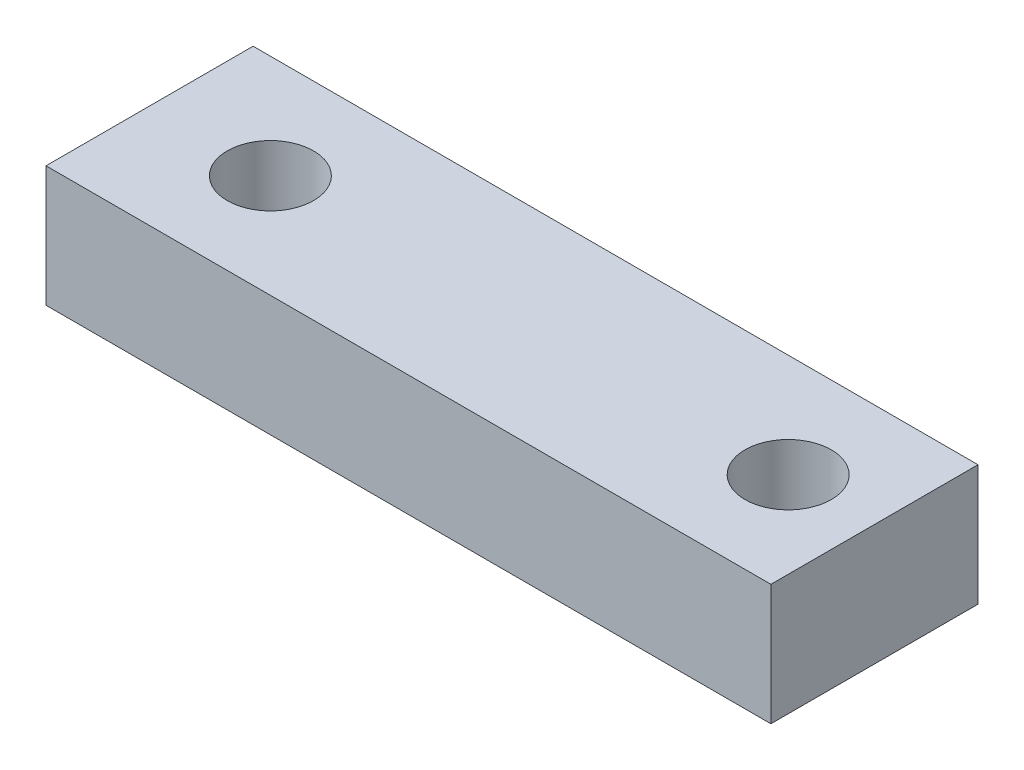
from build123d import *

# Parameters (mm, degrees)
ESQUISSE1_W      = 42
ESQUISSE1_H      = 12
ESQUISSE1_R      = 2.5
EXTRUSION1_DEPTH = 7


with BuildPart() as part:
    # Esquisse1 → Extrusion1 (new body)
    with BuildSketch(Plane(origin=(0, 0, 0), x_dir=(1, 0, 0), z_dir=(0, 1, 0))):
        with Locations((21, 6)):
            Rectangle(ESQUISSE1_W, ESQUISSE1_H)
        with Locations(Location((37, 6, 0), (0, 0, 270))):
            Circle(ESQUISSE1_R, mode=Mode.SUBTRACT)
        with Locations(Location((7, 6, 0), (0, 0, 270))):
            Circle(ESQUISSE1_R, mode=Mode.SUBTRACT)
    extrude(amount=EXTRUSION1_DEPTH)


solid = part.part
